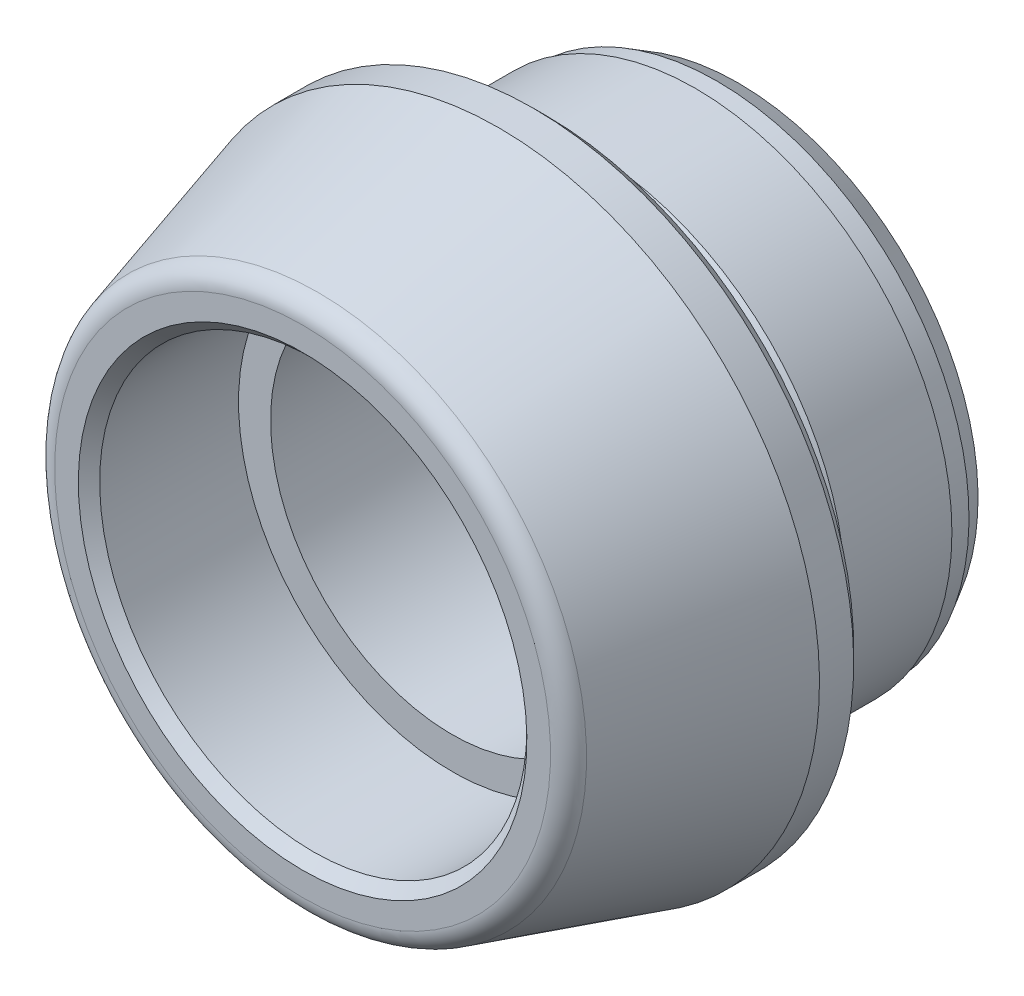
ISO-10303-21;
HEADER;
FILE_DESCRIPTION(('STEP AP214'),'2;1');
FILE_NAME('part.step','',(''),(''),'','','');
FILE_SCHEMA(('AUTOMOTIVE_DESIGN { 1 0 10303 214 1 1 1 1 }'));
ENDSEC;
DATA;
#1=APPLICATION_CONTEXT('core data for automotive mechanical design processes');
#2=APPLICATION_PROTOCOL_DEFINITION('international standard','automotive_design',2000,#1);
#3=PRODUCT_CONTEXT('',#1,'mechanical');
#4=PRODUCT('Part','Part','',(#3));
#5=PRODUCT_RELATED_PRODUCT_CATEGORY('part','',(#4));
#6=PRODUCT_DEFINITION_FORMATION('','',#4);
#7=PRODUCT_DEFINITION_CONTEXT('part definition',#1,'design');
#8=PRODUCT_DEFINITION('design','',#6,#7);
#9=PRODUCT_DEFINITION_SHAPE('','',#8);
#10=(LENGTH_UNIT() NAMED_UNIT(*) SI_UNIT(.MILLI.,.METRE.));
#11=(NAMED_UNIT(*) PLANE_ANGLE_UNIT() SI_UNIT($,.RADIAN.));
#12=(NAMED_UNIT(*) SI_UNIT($,.STERADIAN.) SOLID_ANGLE_UNIT());
#13=UNCERTAINTY_MEASURE_WITH_UNIT(LENGTH_MEASURE(1.E-05),#10,'distance_accuracy_value','');
#14=(GEOMETRIC_REPRESENTATION_CONTEXT(3) GLOBAL_UNCERTAINTY_ASSIGNED_CONTEXT((#13)) GLOBAL_UNIT_ASSIGNED_CONTEXT((#10,
#11,#12)) REPRESENTATION_CONTEXT('',''));
#15=CARTESIAN_POINT('',(0.,0.,0.));
#16=DIRECTION('',(0.,0.,1.));
#17=DIRECTION('',(1.,0.,0.));
#18=AXIS2_PLACEMENT_3D('',#15,#16,#17);
#19=CARTESIAN_POINT('',(0.,0.,5.7));
#20=DIRECTION('',(0.,0.,1.));
#21=DIRECTION('',(0.,-1.,0.));
#22=AXIS2_PLACEMENT_3D('',#19,#20,#21);
#23=CYLINDRICAL_SURFACE('',#22,4.25);
#24=CARTESIAN_POINT('',(0.,0.,-4.));
#25=DIRECTION('',(0.,0.,-1.));
#26=DIRECTION('',(0.,1.,0.));
#27=AXIS2_PLACEMENT_3D('',#24,#25,#26);
#28=CIRCLE('',#27,4.25);
#29=CARTESIAN_POINT('',(0.,4.25,-4.));
#30=VERTEX_POINT('',#29);
#31=EDGE_CURVE('E25',#30,#30,#28,.T.);
#32=ORIENTED_EDGE('',*,*,#31,.T.);
#33=EDGE_LOOP('',(#32));
#34=FACE_BOUND('',#33,.T.);
#35=CARTESIAN_POINT('',(0.,0.,2.2));
#36=DIRECTION('',(0.,0.,1.));
#37=DIRECTION('',(1.,0.,0.));
#38=AXIS2_PLACEMENT_3D('',#35,#36,#37);
#39=CIRCLE('',#38,4.25);
#40=CARTESIAN_POINT('',(4.25,0.,2.2));
#41=VERTEX_POINT('',#40);
#42=EDGE_CURVE('E16',#41,#41,#39,.F.);
#43=ORIENTED_EDGE('',*,*,#42,.F.);
#44=EDGE_LOOP('',(#43));
#45=FACE_BOUND('',#44,.T.);
#46=ADVANCED_FACE('F12',(#34,#45),#23,.F.);
#47=CARTESIAN_POINT('',(0.,0.,-4.5));
#48=DIRECTION('',(0.,0.,-1.));
#49=DIRECTION('',(0.,1.,0.));
#50=AXIS2_PLACEMENT_3D('',#47,#48,#49);
#51=CYLINDRICAL_SURFACE('',#50,6.);
#52=CARTESIAN_POINT('',(0.,0.,-3.5));
#53=DIRECTION('',(0.,0.,-1.));
#54=DIRECTION('',(0.,1.,0.));
#55=AXIS2_PLACEMENT_3D('',#52,#53,#54);
#56=CIRCLE('',#55,6.);
#57=CARTESIAN_POINT('',(0.,6.,-3.5));
#58=VERTEX_POINT('',#57);
#59=EDGE_CURVE('E54',#58,#58,#56,.T.);
#60=ORIENTED_EDGE('',*,*,#59,.F.);
#61=EDGE_LOOP('',(#60));
#62=FACE_BOUND('',#61,.T.);
#63=CARTESIAN_POINT('',(0.,0.,-1.00089511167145));
#64=DIRECTION('',(0.,0.,-1.));
#65=DIRECTION('',(0.,1.,0.));
#66=AXIS2_PLACEMENT_3D('',#63,#64,#65);
#67=CIRCLE('',#66,6.);
#68=CARTESIAN_POINT('',(0.,6.,-1.00089511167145));
#69=VERTEX_POINT('',#68);
#70=EDGE_CURVE('E34',#69,#69,#67,.T.);
#71=ORIENTED_EDGE('',*,*,#70,.T.);
#72=EDGE_LOOP('',(#71));
#73=FACE_BOUND('',#72,.T.);
#74=ADVANCED_FACE('F104',(#62,#73),#51,.T.);
#75=CARTESIAN_POINT('',(7.5,0.,0.));
#76=DIRECTION('',(0.,0.,-1.));
#77=DIRECTION('',(0.,1.,0.));
#78=AXIS2_PLACEMENT_3D('',#75,#76,#77);
#79=PLANE('',#78);
#80=CARTESIAN_POINT('',(0.,0.,0.));
#81=DIRECTION('',(0.,0.,-1.));
#82=DIRECTION('',(0.,1.,0.));
#83=AXIS2_PLACEMENT_3D('',#80,#81,#82);
#84=CIRCLE('',#83,7.2);
#85=CARTESIAN_POINT('',(0.,7.2,0.));
#86=VERTEX_POINT('',#85);
#87=EDGE_CURVE('E75',#86,#86,#84,.T.);
#88=ORIENTED_EDGE('',*,*,#87,.T.);
#89=EDGE_LOOP('',(#88));
#90=FACE_BOUND('',#89,.T.);
#91=CARTESIAN_POINT('',(0.,0.,0.));
#92=DIRECTION('',(0.,0.,-1.));
#93=DIRECTION('',(0.,1.,0.));
#94=AXIS2_PLACEMENT_3D('',#91,#92,#93);
#95=CIRCLE('',#94,6.5);
#96=CARTESIAN_POINT('',(0.,6.5,0.));
#97=VERTEX_POINT('',#96);
#98=EDGE_CURVE('E51',#97,#97,#95,.T.);
#99=ORIENTED_EDGE('',*,*,#98,.F.);
#100=EDGE_LOOP('',(#99));
#101=FACE_BOUND('',#100,.T.);
#102=ADVANCED_FACE('F111',(#90,#101),#79,.T.);
#103=CARTESIAN_POINT('',(6.,0.,-4.5));
#104=DIRECTION('',(0.,0.,-1.));
#105=DIRECTION('',(0.,1.,0.));
#106=AXIS2_PLACEMENT_3D('',#103,#104,#105);
#107=PLANE('',#106);
#108=CARTESIAN_POINT('',(0.,0.,-4.5));
#109=DIRECTION('',(0.,0.,-1.));
#110=DIRECTION('',(0.,1.,0.));
#111=AXIS2_PLACEMENT_3D('',#108,#109,#110);
#112=CIRCLE('',#111,4.75);
#113=CARTESIAN_POINT('',(0.,4.75,-4.5));
#114=VERTEX_POINT('',#113);
#115=EDGE_CURVE('E20',#114,#114,#112,.F.);
#116=ORIENTED_EDGE('',*,*,#115,.T.);
#117=EDGE_LOOP('',(#116));
#118=FACE_BOUND('',#117,.T.);
#119=CARTESIAN_POINT('',(0.,0.,-4.5));
#120=DIRECTION('',(0.,0.,-1.));
#121=DIRECTION('',(0.,1.,0.));
#122=AXIS2_PLACEMENT_3D('',#119,#120,#121);
#123=CIRCLE('',#122,5.61132486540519);
#124=CARTESIAN_POINT('',(0.,5.61132486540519,-4.5));
#125=VERTEX_POINT('',#124);
#126=EDGE_CURVE('E69',#125,#125,#123,.T.);
#127=ORIENTED_EDGE('',*,*,#126,.T.);
#128=EDGE_LOOP('',(#127));
#129=FACE_BOUND('',#128,.T.);
#130=ADVANCED_FACE('F120',(#118,#129),#107,.T.);
#131=CARTESIAN_POINT('',(0.,0.,5.7));
#132=DIRECTION('',(0.,0.,1.));
#133=DIRECTION('',(0.,-1.,0.));
#134=AXIS2_PLACEMENT_3D('',#131,#132,#133);
#135=PLANE('',#134);
#136=CARTESIAN_POINT('',(0.,0.,5.7));
#137=DIRECTION('',(0.,0.,1.));
#138=DIRECTION('',(0.,-1.,0.));
#139=AXIS2_PLACEMENT_3D('',#136,#137,#138);
#140=CIRCLE('',#139,5.25);
#141=CARTESIAN_POINT('',(0.,-5.25,5.7));
#142=VERTEX_POINT('',#141);
#143=EDGE_CURVE('E8',#142,#142,#140,.F.);
#144=ORIENTED_EDGE('',*,*,#143,.T.);
#145=EDGE_LOOP('',(#144));
#146=FACE_BOUND('',#145,.T.);
#147=CARTESIAN_POINT('',(0.,0.,5.7));
#148=DIRECTION('',(0.,0.,1.));
#149=DIRECTION('',(0.,-1.,0.));
#150=AXIS2_PLACEMENT_3D('',#147,#148,#149);
#151=CIRCLE('',#150,5.80419420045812);
#152=CARTESIAN_POINT('',(0.,-5.80419420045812,5.7));
#153=VERTEX_POINT('',#152);
#154=EDGE_CURVE('E66',#153,#153,#151,.T.);
#155=ORIENTED_EDGE('',*,*,#154,.T.);
#156=EDGE_LOOP('',(#155));
#157=FACE_BOUND('',#156,.T.);
#158=ADVANCED_FACE('F129',(#146,#157),#135,.T.);
#159=CARTESIAN_POINT('',(0.,0.,1.1));
#160=DIRECTION('',(0.,0.,-1.));
#161=DIRECTION('',(0.,1.,0.));
#162=AXIS2_PLACEMENT_3D('',#159,#160,#161);
#163=CONICAL_SURFACE('',#162,7.5,0.279252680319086);
#164=CARTESIAN_POINT('',(0.,0.,5.3378186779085));
#165=DIRECTION('',(0.,0.,1.));
#166=DIRECTION('',(0.,-1.,0.));
#167=AXIS2_PLACEMENT_3D('',#164,#165,#166);
#168=CIRCLE('',#167,6.28482504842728);
#169=CARTESIAN_POINT('',(0.,-6.28482504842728,5.3378186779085));
#170=VERTEX_POINT('',#169);
#171=EDGE_CURVE('E63',#170,#170,#168,.F.);
#172=ORIENTED_EDGE('',*,*,#171,.T.);
#173=EDGE_LOOP('',(#172));
#174=FACE_BOUND('',#173,.T.);
#175=CARTESIAN_POINT('',(0.,0.,1.1));
#176=DIRECTION('',(0.,0.,-1.));
#177=DIRECTION('',(0.,1.,0.));
#178=AXIS2_PLACEMENT_3D('',#175,#176,#177);
#179=CIRCLE('',#178,7.5);
#180=CARTESIAN_POINT('',(0.,7.5,1.1));
#181=VERTEX_POINT('',#180);
#182=EDGE_CURVE('E60',#181,#181,#179,.T.);
#183=ORIENTED_EDGE('',*,*,#182,.F.);
#184=EDGE_LOOP('',(#183));
#185=FACE_BOUND('',#184,.T.);
#186=ADVANCED_FACE('F125',(#174,#185),#163,.T.);
#187=CARTESIAN_POINT('',(0.,0.,-4.5));
#188=DIRECTION('',(0.,0.,-1.));
#189=DIRECTION('',(0.,1.,0.));
#190=AXIS2_PLACEMENT_3D('',#187,#188,#189);
#191=CYLINDRICAL_SURFACE('',#190,7.5);
#192=CARTESIAN_POINT('',(0.,0.,0.300000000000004));
#193=DIRECTION('',(0.,0.,-1.));
#194=DIRECTION('',(0.,1.,0.));
#195=AXIS2_PLACEMENT_3D('',#192,#193,#194);
#196=CIRCLE('',#195,7.5);
#197=CARTESIAN_POINT('',(0.,7.5,0.300000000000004));
#198=VERTEX_POINT('',#197);
#199=EDGE_CURVE('E78',#198,#198,#196,.F.);
#200=ORIENTED_EDGE('',*,*,#199,.T.);
#201=EDGE_LOOP('',(#200));
#202=FACE_BOUND('',#201,.T.);
#203=ORIENTED_EDGE('',*,*,#182,.T.);
#204=EDGE_LOOP('',(#203));
#205=FACE_BOUND('',#204,.T.);
#206=ADVANCED_FACE('F122',(#202,#205),#191,.T.);
#207=CARTESIAN_POINT('',(0.,0.,-4.5));
#208=DIRECTION('',(0.,0.,-1.));
#209=DIRECTION('',(0.,1.,0.));
#210=AXIS2_PLACEMENT_3D('',#207,#208,#209);
#211=CYLINDRICAL_SURFACE('',#210,5.9);
#212=CARTESIAN_POINT('',(0.,0.,-4.));
#213=DIRECTION('',(0.,0.,-1.));
#214=DIRECTION('',(0.,1.,0.));
#215=AXIS2_PLACEMENT_3D('',#212,#213,#214);
#216=CIRCLE('',#215,5.9);
#217=CARTESIAN_POINT('',(0.,5.9,-4.));
#218=VERTEX_POINT('',#217);
#219=EDGE_CURVE('E72',#218,#218,#216,.F.);
#220=ORIENTED_EDGE('',*,*,#219,.T.);
#221=EDGE_LOOP('',(#220));
#222=FACE_BOUND('',#221,.T.);
#223=CARTESIAN_POINT('',(0.,0.,-3.5));
#224=DIRECTION('',(0.,0.,-1.));
#225=DIRECTION('',(0.,1.,0.));
#226=AXIS2_PLACEMENT_3D('',#223,#224,#225);
#227=CIRCLE('',#226,5.9);
#228=CARTESIAN_POINT('',(0.,5.9,-3.5));
#229=VERTEX_POINT('',#228);
#230=EDGE_CURVE('E57',#229,#229,#227,.T.);
#231=ORIENTED_EDGE('',*,*,#230,.T.);
#232=EDGE_LOOP('',(#231));
#233=FACE_BOUND('',#232,.T.);
#234=ADVANCED_FACE('F115',(#222,#233),#211,.T.);
#235=CARTESIAN_POINT('',(-5.9,0.,-3.5));
#236=DIRECTION('',(0.,0.,-1.));
#237=DIRECTION('',(0.,1.,0.));
#238=AXIS2_PLACEMENT_3D('',#235,#236,#237);
#239=PLANE('',#238);
#240=ORIENTED_EDGE('',*,*,#59,.T.);
#241=EDGE_LOOP('',(#240));
#242=FACE_BOUND('',#241,.T.);
#243=ORIENTED_EDGE('',*,*,#230,.F.);
#244=EDGE_LOOP('',(#243));
#245=FACE_BOUND('',#244,.T.);
#246=ADVANCED_FACE('F139',(#242,#245),#239,.T.);
#247=CARTESIAN_POINT('',(0.,0.,5.2));
#248=DIRECTION('',(0.,0.,1.));
#249=DIRECTION('',(0.,-1.,0.));
#250=AXIS2_PLACEMENT_3D('',#247,#248,#249);
#251=TOROIDAL_SURFACE('',#250,5.80419420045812,0.5);
#252=ORIENTED_EDGE('',*,*,#154,.F.);
#253=EDGE_LOOP('',(#252));
#254=FACE_BOUND('',#253,.T.);
#255=ORIENTED_EDGE('',*,*,#171,.F.);
#256=EDGE_LOOP('',(#255));
#257=FACE_BOUND('',#256,.T.);
#258=ADVANCED_FACE('F136',(#254,#257),#251,.T.);
#259=CARTESIAN_POINT('',(0.,0.,-4.5));
#260=DIRECTION('',(0.,0.,1.));
#261=DIRECTION('',(0.,-1.,0.));
#262=AXIS2_PLACEMENT_3D('',#259,#260,#261);
#263=CONICAL_SURFACE('',#262,5.61132486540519,0.523598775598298);
#264=ORIENTED_EDGE('',*,*,#219,.F.);
#265=EDGE_LOOP('',(#264));
#266=FACE_BOUND('',#265,.T.);
#267=ORIENTED_EDGE('',*,*,#126,.F.);
#268=EDGE_LOOP('',(#267));
#269=FACE_BOUND('',#268,.T.);
#270=ADVANCED_FACE('F99',(#266,#269),#263,.T.);
#271=CARTESIAN_POINT('',(0.,0.,0.));
#272=DIRECTION('',(0.,0.,1.));
#273=DIRECTION('',(0.,-1.,0.));
#274=AXIS2_PLACEMENT_3D('',#271,#272,#273);
#275=CONICAL_SURFACE('',#274,7.2,0.78539816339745);
#276=ORIENTED_EDGE('',*,*,#199,.F.);
#277=EDGE_LOOP('',(#276));
#278=FACE_BOUND('',#277,.T.);
#279=ORIENTED_EDGE('',*,*,#87,.F.);
#280=EDGE_LOOP('',(#279));
#281=FACE_BOUND('',#280,.T.);
#282=ADVANCED_FACE('F88',(#278,#281),#275,.T.);
#283=CARTESIAN_POINT('',(0.,0.,-4.));
#284=DIRECTION('',(0.,0.,-1.));
#285=DIRECTION('',(0.,1.,0.));
#286=AXIS2_PLACEMENT_3D('',#283,#284,#285);
#287=CONICAL_SURFACE('',#286,4.25,0.785398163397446);
#288=ORIENTED_EDGE('',*,*,#115,.F.);
#289=EDGE_LOOP('',(#288));
#290=FACE_BOUND('',#289,.T.);
#291=ORIENTED_EDGE('',*,*,#31,.F.);
#292=EDGE_LOOP('',(#291));
#293=FACE_BOUND('',#292,.T.);
#294=ADVANCED_FACE('F85',(#290,#293),#287,.F.);
#295=CARTESIAN_POINT('',(0.,0.,0.144526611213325));
#296=DIRECTION('',(0.,0.,-1.));
#297=DIRECTION('',(0.,1.,0.));
#298=AXIS2_PLACEMENT_3D('',#295,#296,#297);
#299=CONICAL_SURFACE('',#298,6.41655447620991,0.523614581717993);
#300=ORIENTED_EDGE('',*,*,#98,.T.);
#301=EDGE_LOOP('',(#300));
#302=FACE_BOUND('',#301,.T.);
#303=CARTESIAN_POINT('',(0.,0.,0.144526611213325));
#304=DIRECTION('',(0.,0.,-1.));
#305=DIRECTION('',(0.,1.,0.));
#306=AXIS2_PLACEMENT_3D('',#303,#304,#305);
#307=CIRCLE('',#306,6.41655447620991);
#308=CARTESIAN_POINT('',(0.,6.41655447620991,0.144526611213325));
#309=VERTEX_POINT('',#308);
#310=EDGE_CURVE('E48',#309,#309,#307,.T.);
#311=ORIENTED_EDGE('',*,*,#310,.F.);
#312=EDGE_LOOP('',(#311));
#313=FACE_BOUND('',#312,.T.);
#314=ADVANCED_FACE('F87',(#302,#313),#299,.F.);
#315=CARTESIAN_POINT('',(0.,0.,-0.1));
#316=DIRECTION('',(0.,0.,-1.));
#317=DIRECTION('',(0.,1.,0.));
#318=AXIS2_PLACEMENT_3D('',#315,#316,#317);
#319=TOROIDAL_SURFACE('',#318,6.1,0.4);
#320=ORIENTED_EDGE('',*,*,#310,.T.);
#321=EDGE_LOOP('',(#320));
#322=FACE_BOUND('',#321,.T.);
#323=CARTESIAN_POINT('',(0.,0.,-0.1));
#324=DIRECTION('',(0.,0.,-1.));
#325=DIRECTION('',(0.,1.,0.));
#326=AXIS2_PLACEMENT_3D('',#323,#324,#325);
#327=CIRCLE('',#326,5.7);
#328=CARTESIAN_POINT('',(0.,5.7,-0.1));
#329=VERTEX_POINT('',#328);
#330=EDGE_CURVE('E45',#329,#329,#327,.T.);
#331=ORIENTED_EDGE('',*,*,#330,.F.);
#332=EDGE_LOOP('',(#331));
#333=FACE_BOUND('',#332,.T.);
#334=ADVANCED_FACE('F96',(#322,#333),#319,.F.);
#335=CARTESIAN_POINT('',(0.,0.,-4.5));
#336=DIRECTION('',(0.,0.,-1.));
#337=DIRECTION('',(0.,1.,0.));
#338=AXIS2_PLACEMENT_3D('',#335,#336,#337);
#339=CYLINDRICAL_SURFACE('',#338,5.7);
#340=ORIENTED_EDGE('',*,*,#330,.T.);
#341=EDGE_LOOP('',(#340));
#342=FACE_BOUND('',#341,.T.);
#343=CARTESIAN_POINT('',(0.,0.,-0.481279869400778));
#344=DIRECTION('',(0.,0.,-1.));
#345=DIRECTION('',(0.,1.,0.));
#346=AXIS2_PLACEMENT_3D('',#343,#344,#345);
#347=CIRCLE('',#346,5.7);
#348=CARTESIAN_POINT('',(0.,5.7,-0.481279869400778));
#349=VERTEX_POINT('',#348);
#350=EDGE_CURVE('E42',#349,#349,#347,.T.);
#351=ORIENTED_EDGE('',*,*,#350,.F.);
#352=EDGE_LOOP('',(#351));
#353=FACE_BOUND('',#352,.T.);
#354=ADVANCED_FACE('F163',(#342,#353),#339,.T.);
#355=CARTESIAN_POINT('',(0.,0.,-1.00089511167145));
#356=DIRECTION('',(0.,0.,-1.));
#357=DIRECTION('',(0.,1.,0.));
#358=AXIS2_PLACEMENT_3D('',#355,#356,#357);
#359=CONICAL_SURFACE('',#358,6.,0.523598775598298);
#360=ORIENTED_EDGE('',*,*,#350,.T.);
#361=EDGE_LOOP('',(#360));
#362=FACE_BOUND('',#361,.T.);
#363=ORIENTED_EDGE('',*,*,#70,.F.);
#364=EDGE_LOOP('',(#363));
#365=FACE_BOUND('',#364,.T.);
#366=ADVANCED_FACE('F167',(#362,#365),#359,.T.);
#367=CARTESIAN_POINT('',(0.,0.,4.7));
#368=DIRECTION('',(0.,0.,1.));
#369=DIRECTION('',(0.,-1.,0.));
#370=AXIS2_PLACEMENT_3D('',#367,#368,#369);
#371=CONICAL_SURFACE('',#370,4.25,0.78539816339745);
#372=CARTESIAN_POINT('',(0.,0.,5.45));
#373=DIRECTION('',(0.,0.,1.));
#374=DIRECTION('',(1.,0.,0.));
#375=AXIS2_PLACEMENT_3D('',#372,#373,#374);
#376=CIRCLE('',#375,5.);
#377=CARTESIAN_POINT('',(5.,0.,5.45));
#378=VERTEX_POINT('',#377);
#379=EDGE_CURVE('E28',#378,#378,#376,.T.);
#380=ORIENTED_EDGE('',*,*,#379,.F.);
#381=EDGE_LOOP('',(#380));
#382=FACE_BOUND('',#381,.T.);
#383=ORIENTED_EDGE('',*,*,#143,.F.);
#384=EDGE_LOOP('',(#383));
#385=FACE_BOUND('',#384,.T.);
#386=ADVANCED_FACE('F14',(#382,#385),#371,.F.);
#387=CARTESIAN_POINT('',(0.,0.,2.2));
#388=DIRECTION('',(0.,0.,1.));
#389=DIRECTION('',(1.,0.,0.));
#390=AXIS2_PLACEMENT_3D('',#387,#388,#389);
#391=PLANE('',#390);
#392=CARTESIAN_POINT('',(0.,0.,2.2));
#393=DIRECTION('',(0.,0.,1.));
#394=DIRECTION('',(1.,0.,0.));
#395=AXIS2_PLACEMENT_3D('',#392,#393,#394);
#396=CIRCLE('',#395,5.);
#397=CARTESIAN_POINT('',(5.,0.,2.2));
#398=VERTEX_POINT('',#397);
#399=EDGE_CURVE('E30',#398,#398,#396,.T.);
#400=ORIENTED_EDGE('',*,*,#399,.T.);
#401=EDGE_LOOP('',(#400));
#402=FACE_BOUND('',#401,.T.);
#403=ORIENTED_EDGE('',*,*,#42,.T.);
#404=EDGE_LOOP('',(#403));
#405=FACE_BOUND('',#404,.T.);
#406=ADVANCED_FACE('F175',(#402,#405),#391,.T.);
#407=CARTESIAN_POINT('',(0.,0.,2.2));
#408=DIRECTION('',(0.,0.,1.));
#409=DIRECTION('',(1.,0.,0.));
#410=AXIS2_PLACEMENT_3D('',#407,#408,#409);
#411=CYLINDRICAL_SURFACE('',#410,5.);
#412=ORIENTED_EDGE('',*,*,#379,.T.);
#413=EDGE_LOOP('',(#412));
#414=FACE_BOUND('',#413,.T.);
#415=ORIENTED_EDGE('',*,*,#399,.F.);
#416=EDGE_LOOP('',(#415));
#417=FACE_BOUND('',#416,.T.);
#418=ADVANCED_FACE('F172',(#414,#417),#411,.F.);
#419=CLOSED_SHELL('',(#46,#74,#102,#130,#158,#186,#206,#234,#246,#258,#270,#282,#294,#314,#334,
#354,#366,#386,#406,#418));
#420=MANIFOLD_SOLID_BREP('B1',#419);
#421=ADVANCED_BREP_SHAPE_REPRESENTATION('',(#18,#420),#14);
#422=SHAPE_DEFINITION_REPRESENTATION(#9,#421);
ENDSEC;
END-ISO-10303-21;
